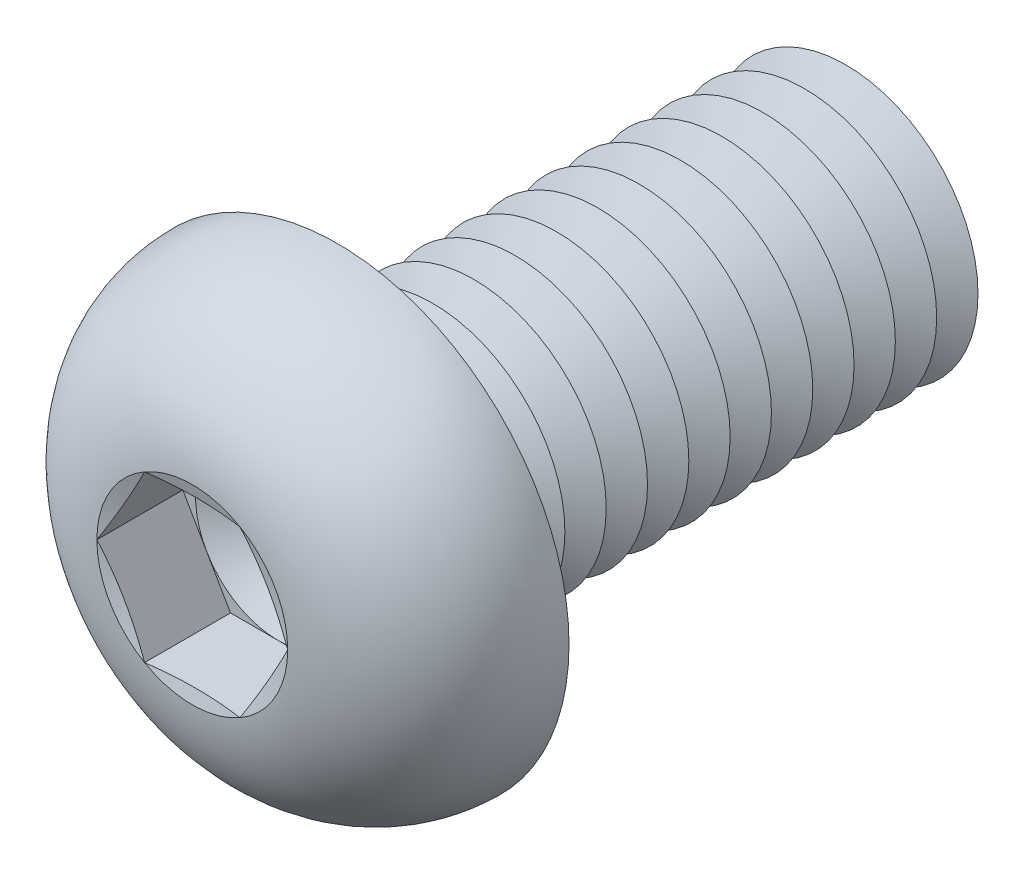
from build123d import *

# Parameters (mm, degrees)
FILLET1_R          = 0.625
LPATTERN1_COUNT    = 12
LPATTERN1_PITCH    = 1.25
CUT_EXTRUDE1_DEPTH = 2.6


with BuildPart() as part:
    # Sketch1 → Revolve1 (revolve)
    with BuildSketch(Plane(origin=(0, 0, 0), x_dir=(0, 0, -1), z_dir=(1, 0, 0)), mode=Mode.PRIVATE) as revolve1_sk:
        with BuildLine():
            Line((0, 4), (0, 7))
            ThreePointArc((0, 7), (-3.011595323, 5.81154966), (-4.4, 2.88675))
            Line((-4.4, 2.88675), (-4.013248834, 1.443375))
            Line((-4.013248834, 1.443375), (-4.4, 1.443375))
            Line((-4.4, 1.443375), (-4.4, 0))
            Line((-4.4, 0), (16, 0))
            Line((16, 0), (16, 4))
            Line((16, 4), (0, 4))
        make_face()
    revolve(revolve1_sk.sketch.rotate(Axis((0, 0, -16), (0, 0, 1)), 90), axis=Axis((0, 0, -16), (0, 0, 1)))

    # Fillet1
    fillet1_edges = [part.edges().sort_by_distance(p)[0] for p in [
        (4, 0, 0),
    ]]
    fillet(fillet1_edges, radius=FILLET1_R)

    # Sketch2 → Cut-Revolve1 (revolve, cut)
    with BuildSketch(Plane(origin=(0, 0, 0), x_dir=(0, 0, -1), z_dir=(1, 0, 0)), mode=Mode.PRIVATE) as cut_revolve1_sk:
        Polygon((15.375, 4), (16.625, 4), (16, 2.917468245), align=None)
    cut_revolve1 = revolve(cut_revolve1_sk.sketch.rotate(Axis((0, 0, -16), (0, 0, -1)), 270), axis=Axis((0, 0, -16), (0, 0, -1)), mode=Mode.SUBTRACT)

    # LPattern1: Cut-Revolve1 ×12
    with Locations(*[(0, 0, i * LPATTERN1_PITCH) for i in range(1, LPATTERN1_COUNT)]):
        add(cut_revolve1, mode=Mode.SUBTRACT)

    # Sketch3 → Cut-Extrude1 (cut)
    with BuildSketch(Plane.XY.offset(4.4)):
        Polygon((1.443375, 2.499998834), (-1.443375, 2.499998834), (-2.88675, 0), (-1.443375, -2.499998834), (1.443375, -2.499998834), (2.88675, 0), align=None)
    extrude(amount=-CUT_EXTRUDE1_DEPTH, mode=Mode.SUBTRACT)

    # Cut-Extrude2 cone 1 section (on through the dimple's axis) → Cut-Extrude2 (revolve, cut)
    with BuildSketch(Plane(origin=(0, 0, 1.8), x_dir=(0, -1, 0), z_dir=(1, 0, 0))):
        Polygon((0, 0), (2.499998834, 0), (0, 1.443375), align=None)
    revolve(axis=Axis((0, 0, 1.8), (0, 0, -1)), mode=Mode.SUBTRACT)


solid = part.part
